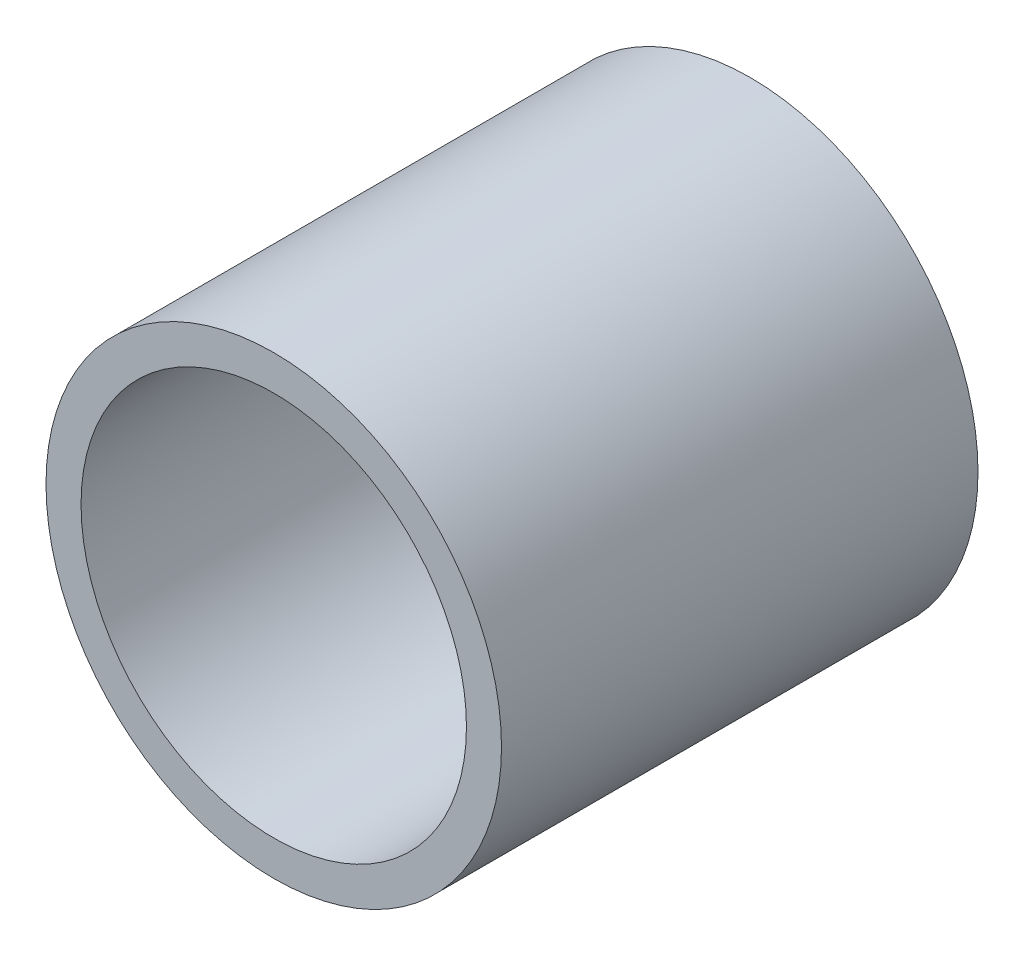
ISO-10303-21;
HEADER;
FILE_DESCRIPTION(('STEP AP214'),'2;1');
FILE_NAME('part.step','',(''),(''),'','','');
FILE_SCHEMA(('AUTOMOTIVE_DESIGN { 1 0 10303 214 1 1 1 1 }'));
ENDSEC;
DATA;
#1=APPLICATION_CONTEXT('core data for automotive mechanical design processes');
#2=APPLICATION_PROTOCOL_DEFINITION('international standard','automotive_design',2000,#1);
#3=PRODUCT_CONTEXT('',#1,'mechanical');
#4=PRODUCT('Part','Part','',(#3));
#5=PRODUCT_RELATED_PRODUCT_CATEGORY('part','',(#4));
#6=PRODUCT_DEFINITION_FORMATION('','',#4);
#7=PRODUCT_DEFINITION_CONTEXT('part definition',#1,'design');
#8=PRODUCT_DEFINITION('design','',#6,#7);
#9=PRODUCT_DEFINITION_SHAPE('','',#8);
#10=(LENGTH_UNIT() NAMED_UNIT(*) SI_UNIT(.MILLI.,.METRE.));
#11=(NAMED_UNIT(*) PLANE_ANGLE_UNIT() SI_UNIT($,.RADIAN.));
#12=(NAMED_UNIT(*) SI_UNIT($,.STERADIAN.) SOLID_ANGLE_UNIT());
#13=UNCERTAINTY_MEASURE_WITH_UNIT(LENGTH_MEASURE(1.E-05),#10,'distance_accuracy_value','');
#14=(GEOMETRIC_REPRESENTATION_CONTEXT(3) GLOBAL_UNCERTAINTY_ASSIGNED_CONTEXT((#13)) GLOBAL_UNIT_ASSIGNED_CONTEXT((#10,
#11,#12)) REPRESENTATION_CONTEXT('',''));
#15=CARTESIAN_POINT('',(0.,0.,0.));
#16=DIRECTION('',(0.,0.,1.));
#17=DIRECTION('',(1.,0.,0.));
#18=AXIS2_PLACEMENT_3D('',#15,#16,#17);
#19=CARTESIAN_POINT('',(0.,0.,13.6));
#20=DIRECTION('',(0.,0.,-1.));
#21=DIRECTION('',(-1.,0.,0.));
#22=AXIS2_PLACEMENT_3D('',#19,#20,#21);
#23=CYLINDRICAL_SURFACE('',#22,6.5);
#24=CARTESIAN_POINT('',(0.,0.,13.6));
#25=DIRECTION('',(0.,0.,1.));
#26=DIRECTION('',(1.,0.,0.));
#27=AXIS2_PLACEMENT_3D('',#24,#25,#26);
#28=CIRCLE('',#27,6.5);
#29=CARTESIAN_POINT('',(6.5,0.,13.6));
#30=VERTEX_POINT('',#29);
#31=EDGE_CURVE('E10',#30,#30,#28,.T.);
#32=ORIENTED_EDGE('',*,*,#31,.F.);
#33=EDGE_LOOP('',(#32));
#34=FACE_BOUND('',#33,.T.);
#35=CARTESIAN_POINT('',(0.,0.,0.));
#36=DIRECTION('',(0.,0.,1.));
#37=DIRECTION('',(1.,0.,0.));
#38=AXIS2_PLACEMENT_3D('',#35,#36,#37);
#39=CIRCLE('',#38,6.5);
#40=CARTESIAN_POINT('',(6.5,0.,0.));
#41=VERTEX_POINT('',#40);
#42=EDGE_CURVE('E37',#41,#41,#39,.T.);
#43=ORIENTED_EDGE('',*,*,#42,.T.);
#44=EDGE_LOOP('',(#43));
#45=FACE_BOUND('',#44,.T.);
#46=ADVANCED_FACE('F30',(#34,#45),#23,.T.);
#47=CARTESIAN_POINT('',(0.,0.,13.6));
#48=DIRECTION('',(0.,0.,1.));
#49=DIRECTION('',(1.,0.,0.));
#50=AXIS2_PLACEMENT_3D('',#47,#48,#49);
#51=PLANE('',#50);
#52=CARTESIAN_POINT('',(0.,0.,13.6));
#53=DIRECTION('',(0.,0.,1.));
#54=DIRECTION('',(1.,0.,0.));
#55=AXIS2_PLACEMENT_3D('',#52,#53,#54);
#56=CIRCLE('',#55,5.5);
#57=CARTESIAN_POINT('',(5.5,0.,13.6));
#58=VERTEX_POINT('',#57);
#59=EDGE_CURVE('E43',#58,#58,#56,.T.);
#60=ORIENTED_EDGE('',*,*,#59,.F.);
#61=EDGE_LOOP('',(#60));
#62=FACE_BOUND('',#61,.T.);
#63=ORIENTED_EDGE('',*,*,#31,.T.);
#64=EDGE_LOOP('',(#63));
#65=FACE_BOUND('',#64,.T.);
#66=ADVANCED_FACE('F59',(#62,#65),#51,.T.);
#67=CARTESIAN_POINT('',(0.,0.,0.));
#68=DIRECTION('',(0.,0.,1.));
#69=DIRECTION('',(1.,0.,0.));
#70=AXIS2_PLACEMENT_3D('',#67,#68,#69);
#71=PLANE('',#70);
#72=CARTESIAN_POINT('',(0.,0.,0.));
#73=DIRECTION('',(0.,0.,1.));
#74=DIRECTION('',(1.,0.,0.));
#75=AXIS2_PLACEMENT_3D('',#72,#73,#74);
#76=CIRCLE('',#75,5.5);
#77=CARTESIAN_POINT('',(5.5,0.,0.));
#78=VERTEX_POINT('',#77);
#79=EDGE_CURVE('E33',#78,#78,#76,.T.);
#80=ORIENTED_EDGE('',*,*,#79,.T.);
#81=EDGE_LOOP('',(#80));
#82=FACE_BOUND('',#81,.T.);
#83=ORIENTED_EDGE('',*,*,#42,.F.);
#84=EDGE_LOOP('',(#83));
#85=FACE_BOUND('',#84,.T.);
#86=ADVANCED_FACE('F50',(#82,#85),#71,.F.);
#87=CARTESIAN_POINT('',(0.,0.,-0.400000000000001));
#88=DIRECTION('',(0.,0.,1.));
#89=DIRECTION('',(1.,0.,0.));
#90=AXIS2_PLACEMENT_3D('',#87,#88,#89);
#91=CYLINDRICAL_SURFACE('',#90,5.5);
#92=ORIENTED_EDGE('',*,*,#59,.T.);
#93=EDGE_LOOP('',(#92));
#94=FACE_BOUND('',#93,.T.);
#95=ORIENTED_EDGE('',*,*,#79,.F.);
#96=EDGE_LOOP('',(#95));
#97=FACE_BOUND('',#96,.T.);
#98=ADVANCED_FACE('F53',(#94,#97),#91,.F.);
#99=CLOSED_SHELL('',(#46,#66,#86,#98));
#100=MANIFOLD_SOLID_BREP('B2',#99);
#101=ADVANCED_BREP_SHAPE_REPRESENTATION('',(#18,#100),#14);
#102=SHAPE_DEFINITION_REPRESENTATION(#9,#101);
ENDSEC;
END-ISO-10303-21;
